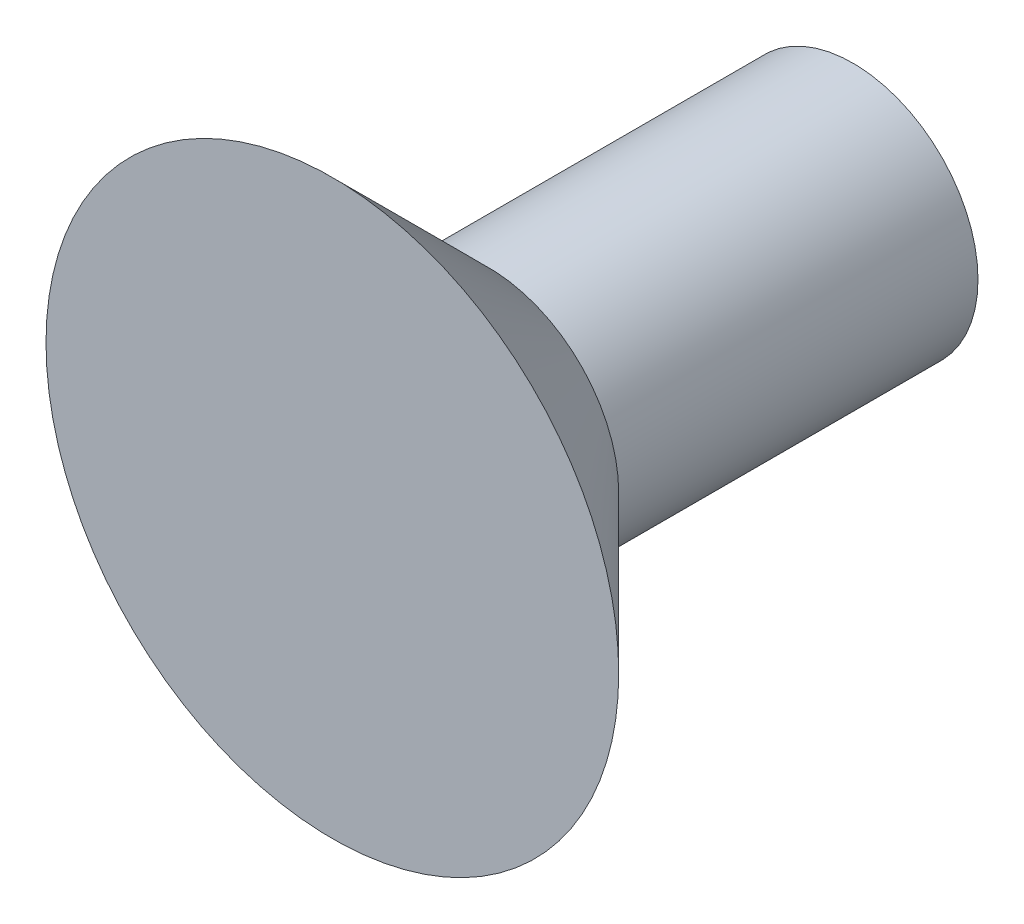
from build123d import *

# Parameters (mm, degrees)
IZIM1_R                     = 2.4
Y_KSEKLIK_EKSTR_ZYON1_DEPTH = 7
IZIM2_R                     = 2.5
Y_KSEKLIK_EKSTR_ZYON2_DEPTH = 3
Y_KSEKLIK_EKSTR_ZYON2_DRAFT = -45


with BuildPart() as part:
    # izim1 → Y_kseklik-Ekstr_zyon1 (new body)
    with BuildSketch(Plane.XY):
        Circle(IZIM1_R)
    extrude(amount=Y_KSEKLIK_EKSTR_ZYON1_DEPTH)


with BuildPart() as y_kseklik_ekstr_zyon2_tool:
    # izim2 → Y_kseklik-Ekstr_zyon2 (with draft: the straight prism first)
    with BuildSketch(Plane.XY.offset(7)):
        Circle(IZIM2_R)
    extrude(amount=Y_KSEKLIK_EKSTR_ZYON2_DEPTH)
    # Y_kseklik-Ekstr_zyon2: the draft: its side faces are tilted about the plane it starts from
    y_kseklik_ekstr_zyon2_sides = [y_kseklik_ekstr_zyon2_tool.faces().sort_by_distance(p)[0] for p in [
        (-2.5, 0, 8.5),
    ]]
    draft(y_kseklik_ekstr_zyon2_sides, Plane.XY.offset(7), Y_KSEKLIK_EKSTR_ZYON2_DRAFT)


with BuildPart() as part_1:
    add(part.part)

    # Y_kseklik-Ekstr_zyon2: add y_kseklik_ekstr_zyon2_tool
    add(y_kseklik_ekstr_zyon2_tool.part)


solid = part_1.part
